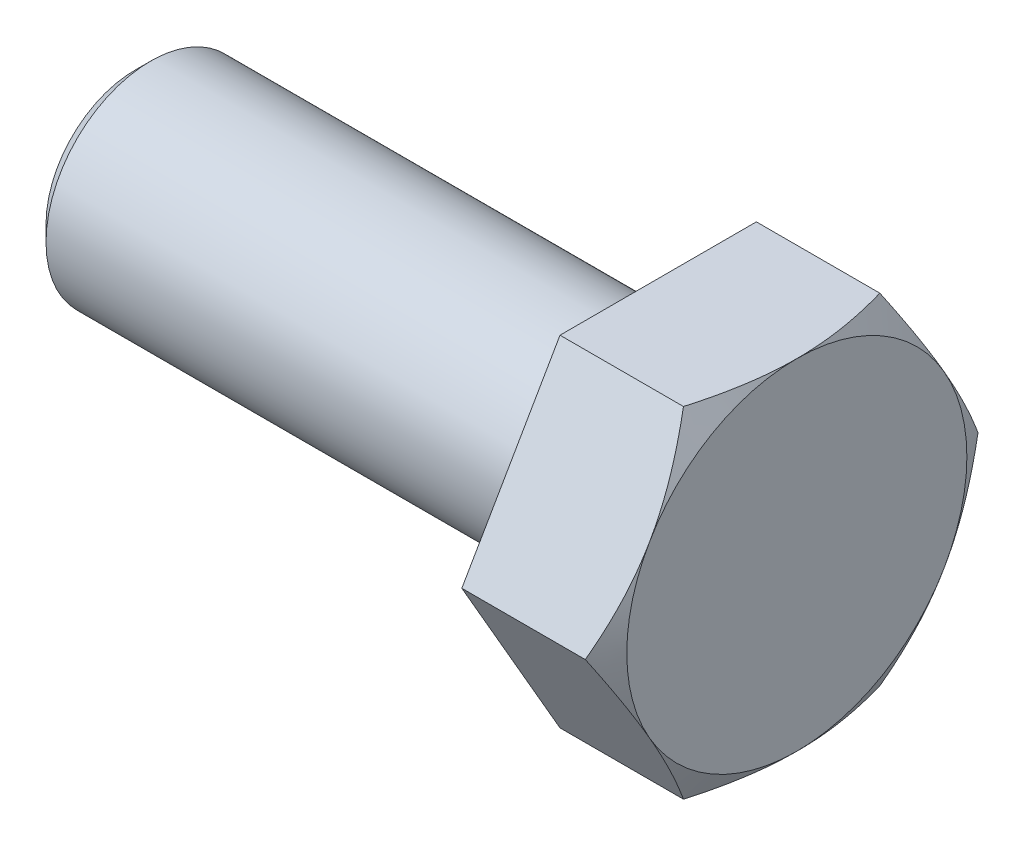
ISO-10303-21;
HEADER;
FILE_DESCRIPTION(('STEP AP214'),'2;1');
FILE_NAME('part.step','',(''),(''),'','','');
FILE_SCHEMA(('AUTOMOTIVE_DESIGN { 1 0 10303 214 1 1 1 1 }'));
ENDSEC;
DATA;
#1=APPLICATION_CONTEXT('core data for automotive mechanical design processes');
#2=APPLICATION_PROTOCOL_DEFINITION('international standard','automotive_design',2000,#1);
#3=PRODUCT_CONTEXT('',#1,'mechanical');
#4=PRODUCT('Part','Part','',(#3));
#5=PRODUCT_RELATED_PRODUCT_CATEGORY('part','',(#4));
#6=PRODUCT_DEFINITION_FORMATION('','',#4);
#7=PRODUCT_DEFINITION_CONTEXT('part definition',#1,'design');
#8=PRODUCT_DEFINITION('design','',#6,#7);
#9=PRODUCT_DEFINITION_SHAPE('','',#8);
#10=(LENGTH_UNIT() NAMED_UNIT(*) SI_UNIT(.MILLI.,.METRE.));
#11=(NAMED_UNIT(*) PLANE_ANGLE_UNIT() SI_UNIT($,.RADIAN.));
#12=(NAMED_UNIT(*) SI_UNIT($,.STERADIAN.) SOLID_ANGLE_UNIT());
#13=UNCERTAINTY_MEASURE_WITH_UNIT(LENGTH_MEASURE(1.E-05),#10,'distance_accuracy_value','');
#14=(GEOMETRIC_REPRESENTATION_CONTEXT(3) GLOBAL_UNCERTAINTY_ASSIGNED_CONTEXT((#13)) GLOBAL_UNIT_ASSIGNED_CONTEXT((#10,
#11,#12)) REPRESENTATION_CONTEXT('',''));
#15=CARTESIAN_POINT('',(0.,0.,0.));
#16=DIRECTION('',(0.,0.,1.));
#17=DIRECTION('',(1.,0.,0.));
#18=AXIS2_PLACEMENT_3D('',#15,#16,#17);
#19=CARTESIAN_POINT('',(0.,-6.50000000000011,-3.75277674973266));
#20=DIRECTION('',(-1.,0.,0.));
#21=DIRECTION('',(0.,0.,1.));
#22=AXIS2_PLACEMENT_3D('',#19,#20,#21);
#23=PLANE('',#22);
#24=DIRECTION('',(0.,0.866025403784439,-0.5));
#25=VECTOR('',#24,1.);
#26=CARTESIAN_POINT('',(0.,-6.50000000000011,-3.75277674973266));
#27=LINE('',#26,#25);
#28=CARTESIAN_POINT('',(0.,-6.50000000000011,-3.75277674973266));
#29=VERTEX_POINT('',#28);
#30=CARTESIAN_POINT('',(0.,-1.11022302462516E-13,-7.50555349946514));
#31=VERTEX_POINT('',#30);
#32=EDGE_CURVE('E219',#29,#31,#27,.T.);
#33=ORIENTED_EDGE('',*,*,#32,.F.);
#34=DIRECTION('',(0.,0.,-1.));
#35=VECTOR('',#34,1.);
#36=CARTESIAN_POINT('',(0.,-6.50000000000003,3.75277674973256));
#37=LINE('',#36,#35);
#38=CARTESIAN_POINT('',(0.,-6.50000000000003,3.75277674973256));
#39=VERTEX_POINT('',#38);
#40=EDGE_CURVE('E238',#39,#29,#37,.T.);
#41=ORIENTED_EDGE('',*,*,#40,.F.);
#42=DIRECTION('',(0.,-0.866025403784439,-0.5));
#43=VECTOR('',#42,1.);
#44=CARTESIAN_POINT('',(-1.11022302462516E-13,0.,7.50555349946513));
#45=LINE('',#44,#43);
#46=CARTESIAN_POINT('',(-1.11022302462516E-13,0.,7.50555349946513));
#47=VERTEX_POINT('',#46);
#48=EDGE_CURVE('E235',#47,#39,#45,.T.);
#49=ORIENTED_EDGE('',*,*,#48,.F.);
#50=DIRECTION('',(0.,-0.866025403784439,0.5));
#51=VECTOR('',#50,1.);
#52=CARTESIAN_POINT('',(0.,6.49999999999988,3.75277674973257));
#53=LINE('',#52,#51);
#54=CARTESIAN_POINT('',(0.,6.49999999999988,3.75277674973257));
#55=VERTEX_POINT('',#54);
#56=EDGE_CURVE('E233',#55,#47,#53,.T.);
#57=ORIENTED_EDGE('',*,*,#56,.F.);
#58=DIRECTION('',(0.,0.,1.));
#59=VECTOR('',#58,1.);
#60=CARTESIAN_POINT('',(0.,6.49999999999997,-3.75277674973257));
#61=LINE('',#60,#59);
#62=CARTESIAN_POINT('',(0.,6.49999999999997,-3.75277674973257));
#63=VERTEX_POINT('',#62);
#64=EDGE_CURVE('E230',#63,#55,#61,.T.);
#65=ORIENTED_EDGE('',*,*,#64,.F.);
#66=DIRECTION('',(0.,0.866025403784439,0.5));
#67=VECTOR('',#66,1.);
#68=CARTESIAN_POINT('',(0.,-1.11022302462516E-13,-7.50555349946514));
#69=LINE('',#68,#67);
#70=EDGE_CURVE('E222',#31,#63,#69,.T.);
#71=ORIENTED_EDGE('',*,*,#70,.F.);
#72=EDGE_LOOP('',(#33,#41,#49,#57,#65,#71));
#73=FACE_BOUND('',#72,.T.);
#74=CARTESIAN_POINT('',(0.,0.,0.));
#75=DIRECTION('',(-1.,0.,0.));
#76=DIRECTION('',(0.,0.,1.));
#77=AXIS2_PLACEMENT_3D('',#74,#75,#76);
#78=CIRCLE('',#77,4.);
#79=CARTESIAN_POINT('',(0.,0.,4.));
#80=VERTEX_POINT('',#79);
#81=EDGE_CURVE('E217',#80,#80,#78,.T.);
#82=ORIENTED_EDGE('',*,*,#81,.F.);
#83=EDGE_LOOP('',(#82));
#84=FACE_BOUND('',#83,.T.);
#85=ADVANCED_FACE('F43',(#73,#84),#23,.T.);
#86=CARTESIAN_POINT('',(5.30000000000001,-6.5000000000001,-3.75277674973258));
#87=DIRECTION('',(0.,0.5,0.866025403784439));
#88=DIRECTION('',(0.,-0.866025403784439,0.5));
#89=AXIS2_PLACEMENT_3D('',#86,#87,#88);
#90=PLANE('',#89);
#91=DIRECTION('',(-1.,0.,0.));
#92=VECTOR('',#91,1.);
#93=CARTESIAN_POINT('',(5.29999999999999,0.,-7.50555349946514));
#94=LINE('',#93,#92);
#95=CARTESIAN_POINT('',(4.71944341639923,0.,-7.50555349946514));
#96=VERTEX_POINT('',#95);
#97=EDGE_CURVE('E137',#96,#31,#94,.T.);
#98=ORIENTED_EDGE('',*,*,#97,.F.);
#99=CARTESIAN_POINT('',(4.71937674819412,0.000199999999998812,-7.50566896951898));
#100=CARTESIAN_POINT('',(4.76699557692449,-0.142677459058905,-7.42317863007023));
#101=CARTESIAN_POINT('',(4.81245329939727,-0.286087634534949,-7.34038072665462));
#102=CARTESIAN_POINT('',(4.89845131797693,-0.574072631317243,-7.1741125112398));
#103=CARTESIAN_POINT('',(4.93898949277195,-0.718647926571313,-7.09064192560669));
#104=CARTESIAN_POINT('',(5.05242899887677,-1.15468865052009,-6.83889369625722));
#105=CARTESIAN_POINT('',(5.11695219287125,-1.44787528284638,-6.66962231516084));
#106=CARTESIAN_POINT('',(5.1926134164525,-1.88662374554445,-6.41631077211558));
#107=CARTESIAN_POINT('',(5.214167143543,-2.03087463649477,-6.33302748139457));
#108=CARTESIAN_POINT('',(5.25030968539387,-2.32002821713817,-6.16608458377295));
#109=CARTESIAN_POINT('',(5.26489911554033,-2.46493084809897,-6.08242501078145));
#110=CARTESIAN_POINT('',(5.28674124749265,-2.75498777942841,-5.91496056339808));
#111=CARTESIAN_POINT('',(5.29400227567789,-2.90014160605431,-5.83115596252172));
#112=CARTESIAN_POINT('',(5.30103969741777,-3.19057533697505,-5.66347396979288));
#113=CARTESIAN_POINT('',(5.3008163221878,-3.33585523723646,-5.57959658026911));
#114=CARTESIAN_POINT('',(5.28991654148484,-3.73387594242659,-5.34979921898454));
#115=CARTESIAN_POINT('',(5.27161818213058,-3.98648646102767,-5.20395446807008));
#116=CARTESIAN_POINT('',(5.21359365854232,-4.49002967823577,-4.91323365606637));
#117=CARTESIAN_POINT('',(5.17384766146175,-4.74096060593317,-4.76835861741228));
#118=CARTESIAN_POINT('',(5.07449409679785,-5.2455172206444,-4.47705272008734));
#119=CARTESIAN_POINT('',(5.01446557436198,-5.49907924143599,-4.33065861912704));
#120=CARTESIAN_POINT('',(4.87822500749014,-6.00242193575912,-4.04005357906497));
#121=CARTESIAN_POINT('',(4.80204496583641,-6.25220905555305,-3.89583891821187));
#122=CARTESIAN_POINT('',(4.71937674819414,-6.5002000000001,-3.75266127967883));
#123=B_SPLINE_CURVE_WITH_KNOTS('',3,(#99,#100,#101,#102,#103,#104,#105,#106,#107,#108,#109,#110,
#111,#112,#113,#114,#115,#116,#117,#118,#119,#120,#121,#122),.UNSPECIFIED.,.F.,.F.,(4,2,2,2,2,2,
2,2,2,2,2,4),(0.,0.515105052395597,1.03043143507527,2.06322554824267,2.56697389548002,
3.0706777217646,3.57380860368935,4.07692394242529,4.95279354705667,5.82947446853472,
6.72559912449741,7.61996451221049),.UNSPECIFIED.);
#124=CARTESIAN_POINT('',(5.30000000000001,-3.2500000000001,-5.62916512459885));
#125=VERTEX_POINT('',#124);
#126=EDGE_CURVE('E151',#96,#125,#123,.T.);
#127=ORIENTED_EDGE('',*,*,#126,.T.);
#128=CARTESIAN_POINT('',(4.71944341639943,-6.5000000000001,-3.75277674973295));
#129=VERTEX_POINT('',#128);
#130=EDGE_CURVE('E159',#125,#129,#123,.T.);
#131=ORIENTED_EDGE('',*,*,#130,.T.);
#132=DIRECTION('',(-1.,0.,0.));
#133=VECTOR('',#132,1.);
#134=CARTESIAN_POINT('',(5.30000000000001,-6.5000000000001,-3.75277674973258));
#135=LINE('',#134,#133);
#136=EDGE_CURVE('E241',#129,#29,#135,.T.);
#137=ORIENTED_EDGE('',*,*,#136,.T.);
#138=ORIENTED_EDGE('',*,*,#32,.T.);
#139=EDGE_LOOP('',(#98,#127,#131,#137,#138));
#140=FACE_BOUND('',#139,.T.);
#141=ADVANCED_FACE('F45',(#140),#90,.F.);
#142=CARTESIAN_POINT('',(5.29999999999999,0.,-7.50555349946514));
#143=DIRECTION('',(0.,-0.5,0.866025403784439));
#144=DIRECTION('',(0.,-0.866025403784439,-0.5));
#145=AXIS2_PLACEMENT_3D('',#142,#143,#144);
#146=PLANE('',#145);
#147=DIRECTION('',(-1.,0.,0.));
#148=VECTOR('',#147,1.);
#149=CARTESIAN_POINT('',(5.3,6.49999999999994,-3.75277674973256));
#150=LINE('',#149,#148);
#151=CARTESIAN_POINT('',(4.71944341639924,6.49999999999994,-3.75277674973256));
#152=VERTEX_POINT('',#151);
#153=EDGE_CURVE('E248',#152,#63,#150,.T.);
#154=ORIENTED_EDGE('',*,*,#153,.F.);
#155=CARTESIAN_POINT('',(4.71937674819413,6.50019999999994,-3.75266127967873));
#156=CARTESIAN_POINT('',(4.76699557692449,6.35732254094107,-3.83515161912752));
#157=CARTESIAN_POINT('',(4.81245329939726,6.21391236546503,-3.91794952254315));
#158=CARTESIAN_POINT('',(4.89845131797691,5.92592736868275,-4.08421773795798));
#159=CARTESIAN_POINT('',(4.93898949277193,5.78135207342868,-4.16768832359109));
#160=CARTESIAN_POINT('',(5.05242899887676,5.34531134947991,-4.41943655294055));
#161=CARTESIAN_POINT('',(5.11695219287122,5.05212471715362,-4.58870793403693));
#162=CARTESIAN_POINT('',(5.19261341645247,4.61337625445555,-4.8420194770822));
#163=CARTESIAN_POINT('',(5.21416714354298,4.46912536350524,-4.92530276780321));
#164=CARTESIAN_POINT('',(5.25030968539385,4.17997178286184,-5.09224566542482));
#165=CARTESIAN_POINT('',(5.2648991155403,4.03506915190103,-5.17590523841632));
#166=CARTESIAN_POINT('',(5.28674124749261,3.7450122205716,-5.34336968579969));
#167=CARTESIAN_POINT('',(5.29400227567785,3.59985839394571,-5.42717428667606));
#168=CARTESIAN_POINT('',(5.30103969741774,3.30942466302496,-5.59485627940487));
#169=CARTESIAN_POINT('',(5.3008163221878,3.16414476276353,-5.67873366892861));
#170=CARTESIAN_POINT('',(5.28991654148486,2.76612405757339,-5.90853103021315));
#171=CARTESIAN_POINT('',(5.27161818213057,2.51351353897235,-6.05437578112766));
#172=CARTESIAN_POINT('',(5.21359365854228,2.00997032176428,-6.3450965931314));
#173=CARTESIAN_POINT('',(5.17384766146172,1.75903939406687,-6.48997163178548));
#174=CARTESIAN_POINT('',(5.07449409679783,1.25448277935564,-6.7812775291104));
#175=CARTESIAN_POINT('',(5.01446557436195,1.00092075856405,-6.92767163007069));
#176=CARTESIAN_POINT('',(4.87822500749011,0.497578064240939,-7.21827667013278));
#177=CARTESIAN_POINT('',(4.80204496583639,0.247790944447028,-7.3624913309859));
#178=CARTESIAN_POINT('',(4.71937674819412,-0.000200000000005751,-7.50566896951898));
#179=B_SPLINE_CURVE_WITH_KNOTS('',3,(#155,#156,#157,#158,#159,#160,#161,#162,#163,#164,#165,
#166,#167,#168,#169,#170,#171,#172,#173,#174,#175,#176,#177,#178),.UNSPECIFIED.,.F.,.F.,(4,2,2,
2,2,2,2,2,2,2,2,4),(0.,0.51510505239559,1.03043143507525,2.06322554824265,2.56697389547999,
3.07067772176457,3.57380860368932,4.07692394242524,4.95279354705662,5.82947446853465,
6.72559912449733,7.6199645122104),.UNSPECIFIED.);
#180=CARTESIAN_POINT('',(5.3,3.24999999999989,-5.62916512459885));
#181=VERTEX_POINT('',#180);
#182=EDGE_CURVE('E126',#152,#181,#179,.T.);
#183=ORIENTED_EDGE('',*,*,#182,.T.);
#184=EDGE_CURVE('E148',#181,#96,#179,.T.);
#185=ORIENTED_EDGE('',*,*,#184,.T.);
#186=ORIENTED_EDGE('',*,*,#97,.T.);
#187=ORIENTED_EDGE('',*,*,#70,.T.);
#188=EDGE_LOOP('',(#154,#183,#185,#186,#187));
#189=FACE_BOUND('',#188,.T.);
#190=ADVANCED_FACE('F263',(#189),#146,.F.);
#191=CARTESIAN_POINT('',(5.3,6.49999999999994,-3.75277674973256));
#192=DIRECTION('',(0.,-1.,0.));
#193=DIRECTION('',(0.,0.,-1.));
#194=AXIS2_PLACEMENT_3D('',#191,#192,#193);
#195=PLANE('',#194);
#196=DIRECTION('',(-1.,0.,0.));
#197=VECTOR('',#196,1.);
#198=CARTESIAN_POINT('',(5.3,6.49999999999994,3.75277674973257));
#199=LINE('',#198,#197);
#200=CARTESIAN_POINT('',(4.71944341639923,6.49999999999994,3.75277674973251));
#201=VERTEX_POINT('',#200);
#202=EDGE_CURVE('E246',#201,#55,#199,.T.);
#203=ORIENTED_EDGE('',*,*,#202,.F.);
#204=CARTESIAN_POINT('',(2.048837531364,6.49999999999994,-10.242826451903));
#205=CARTESIAN_POINT('',(2.18789595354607,6.49999999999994,-9.95749124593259));
#206=CARTESIAN_POINT('',(2.32566707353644,6.49999999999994,-9.6715181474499));
#207=CARTESIAN_POINT('',(2.59791369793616,6.49999999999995,-9.09795747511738));
#208=CARTESIAN_POINT('',(2.73238871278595,6.49999999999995,-8.81036966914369));
#209=CARTESIAN_POINT('',(2.99796413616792,6.49999999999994,-8.2318359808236));
#210=CARTESIAN_POINT('',(3.12904354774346,6.49999999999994,-7.9408804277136));
#211=CARTESIAN_POINT('',(3.3860497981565,6.49999999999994,-7.35671087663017));
#212=CARTESIAN_POINT('',(3.51197687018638,6.49999999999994,-7.0634969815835));
#213=CARTESIAN_POINT('',(3.76148583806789,6.49999999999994,-6.46434921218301));
#214=CARTESIAN_POINT('',(3.88484316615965,6.49999999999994,-6.15832132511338));
#215=CARTESIAN_POINT('',(4.12260875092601,6.49999999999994,-5.54274557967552));
#216=CARTESIAN_POINT('',(4.23701602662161,6.49999999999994,-5.23319733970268));
#217=CARTESIAN_POINT('',(4.45399730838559,6.49999999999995,-4.61061796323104));
#218=CARTESIAN_POINT('',(4.55659391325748,6.49999999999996,-4.29759477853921));
#219=CARTESIAN_POINT('',(4.74676876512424,6.49999999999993,-3.6670577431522));
#220=CARTESIAN_POINT('',(4.83435157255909,6.49999999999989,-3.34954528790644));
#221=CARTESIAN_POINT('',(4.98994277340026,6.49999999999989,-2.71162315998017));
#222=CARTESIAN_POINT('',(5.05806094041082,6.49999999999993,-2.39124068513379));
#223=CARTESIAN_POINT('',(5.17096432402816,6.49999999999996,-1.74628166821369));
#224=CARTESIAN_POINT('',(5.21575208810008,6.49999999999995,-1.42170558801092));
#225=CARTESIAN_POINT('',(5.26247031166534,6.49999999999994,-0.935153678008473));
#226=CARTESIAN_POINT('',(5.27461755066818,6.49999999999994,-0.774120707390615));
#227=CARTESIAN_POINT('',(5.29209027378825,6.49999999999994,-0.451677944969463));
#228=CARTESIAN_POINT('',(5.29741587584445,6.49999999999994,-0.290268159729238));
#229=CARTESIAN_POINT('',(5.30111032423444,6.49999999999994,0.0326315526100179));
#230=CARTESIAN_POINT('',(5.29947913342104,6.49999999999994,0.19412148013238));
#231=CARTESIAN_POINT('',(5.28930353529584,6.49999999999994,0.516885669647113));
#232=CARTESIAN_POINT('',(5.28075881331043,6.49999999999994,0.678159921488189));
#233=CARTESIAN_POINT('',(5.25246253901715,6.49999999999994,1.06087214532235));
#234=CARTESIAN_POINT('',(5.22970222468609,6.49999999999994,1.28209275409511));
#235=CARTESIAN_POINT('',(5.17237790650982,6.49999999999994,1.72298724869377));
#236=CARTESIAN_POINT('',(5.13781243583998,6.49999999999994,1.94266093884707));
#237=CARTESIAN_POINT('',(5.01823337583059,6.49999999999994,2.59905069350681));
#238=CARTESIAN_POINT('',(4.91735524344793,6.49999999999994,3.03292019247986));
#239=CARTESIAN_POINT('',(4.7411776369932,6.49999999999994,3.68203060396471));
#240=CARTESIAN_POINT('',(4.67743243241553,6.49999999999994,3.90060193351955));
#241=CARTESIAN_POINT('',(4.54301316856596,6.49999999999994,4.33562457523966));
#242=CARTESIAN_POINT('',(4.47233905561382,6.49999999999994,4.55207587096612));
#243=CARTESIAN_POINT('',(4.32522134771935,6.49999999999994,4.98292315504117));
#244=CARTESIAN_POINT('',(4.2487793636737,6.49999999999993,5.19731969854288));
#245=CARTESIAN_POINT('',(4.09105605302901,6.49999999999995,5.62431368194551));
#246=CARTESIAN_POINT('',(4.00977483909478,6.49999999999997,5.83691116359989));
#247=CARTESIAN_POINT('',(3.78396124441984,6.49999999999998,6.41107024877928));
#248=CARTESIAN_POINT('',(3.63553739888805,6.49999999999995,6.77109994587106));
#249=CARTESIAN_POINT('',(3.32991367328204,6.49999999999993,7.48742894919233));
#250=CARTESIAN_POINT('',(3.17271280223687,6.49999999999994,7.84372782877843));
#251=CARTESIAN_POINT('',(2.85162072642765,6.49999999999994,8.55345570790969));
#252=CARTESIAN_POINT('',(2.68772693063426,6.49999999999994,8.90688353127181));
#253=CARTESIAN_POINT('',(2.35485675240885,6.49999999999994,9.61131133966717));
#254=CARTESIAN_POINT('',(2.18588058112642,6.49999999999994,9.96231142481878));
#255=CARTESIAN_POINT('',(1.84367823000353,6.49999999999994,10.6629371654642));
#256=CARTESIAN_POINT('',(1.67044558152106,6.49999999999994,11.0125596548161));
#257=CARTESIAN_POINT('',(1.32082260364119,6.49999999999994,11.7102232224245));
#258=CARTESIAN_POINT('',(1.14443224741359,6.49999999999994,12.0582642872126));
#259=CARTESIAN_POINT('',(0.789156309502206,6.49999999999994,12.7529700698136));
#260=CARTESIAN_POINT('',(0.610271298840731,6.49999999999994,13.0996350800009));
#261=CARTESIAN_POINT('',(0.250435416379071,6.49999999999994,13.7918918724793));
#262=CARTESIAN_POINT('',(0.0694845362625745,6.49999999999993,14.1374836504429));
#263=CARTESIAN_POINT('',(-0.437179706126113,6.49999999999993,15.0993998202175));
#264=CARTESIAN_POINT('',(-0.76474827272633,6.49999999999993,15.7147468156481));
#265=CARTESIAN_POINT('',(-1.42381233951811,6.49999999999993,16.9433793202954));
#266=CARTESIAN_POINT('',(-1.75530808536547,6.49999999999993,17.5566646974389));
#267=CARTESIAN_POINT('',(-2.42008717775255,6.49999999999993,18.7795711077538));
#268=CARTESIAN_POINT('',(-2.75336064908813,6.49999999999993,19.3891975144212));
#269=CARTESIAN_POINT('',(-3.42213981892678,6.49999999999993,20.6071616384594));
#270=CARTESIAN_POINT('',(-3.75764533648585,6.49999999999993,21.215499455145));
#271=CARTESIAN_POINT('',(-4.09396124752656,6.49999999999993,21.8233856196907));
#272=B_SPLINE_CURVE_WITH_KNOTS('',3,(#204,#205,#206,#207,#208,#209,#210,#211,#212,#213,#214,
#215,#216,#217,#218,#219,#220,#221,#222,#223,#224,#225,#226,#227,#228,#229,#230,#231,#232,#233,
#234,#235,#236,#237,#238,#239,#240,#241,#242,#243,#244,#245,#246,#247,#248,#249,#250,#251,#252,
#253,#254,#255,#256,#257,#258,#259,#260,#261,#262,#263,#264,#265,#266,#267,#268,#269,#270,#271),
.UNSPECIFIED.,.F.,.F.,(4,2,2,2,2,2,2,2,2,2,2,2,2,2,2,2,2,2,2,2,2,2,2,2,2,2,2,2,2,2,2,2,2,4),(0.,
0.952261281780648,1.90466315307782,2.86198011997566,3.81925371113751,4.80900961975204,
5.79887385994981,6.78681143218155,7.77444838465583,8.75640023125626,9.73824483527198,
10.222593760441,10.7069343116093,11.1912774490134,11.6756426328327,12.3424346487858,
13.0093095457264,14.3437044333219,15.0266742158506,15.7096492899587,16.3924343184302,
17.0752034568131,18.2433007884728,19.4115302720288,20.580216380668,21.7488540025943,
22.9193933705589,24.0899426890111,25.2602283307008,26.430518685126,28.5218066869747,
30.6132262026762,32.6975528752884,34.7817125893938),.UNSPECIFIED.);
#273=CARTESIAN_POINT('',(5.3,6.49999999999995,0.));
#274=VERTEX_POINT('',#273);
#275=EDGE_CURVE('E121',#201,#274,#272,.F.);
#276=ORIENTED_EDGE('',*,*,#275,.T.);
#277=EDGE_CURVE('E125',#274,#152,#272,.F.);
#278=ORIENTED_EDGE('',*,*,#277,.T.);
#279=ORIENTED_EDGE('',*,*,#153,.T.);
#280=ORIENTED_EDGE('',*,*,#64,.T.);
#281=EDGE_LOOP('',(#203,#276,#278,#279,#280));
#282=FACE_BOUND('',#281,.T.);
#283=ADVANCED_FACE('F268',(#282),#195,.F.);
#284=CARTESIAN_POINT('',(5.3,6.49999999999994,3.75277674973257));
#285=DIRECTION('',(0.,-0.5,-0.866025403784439));
#286=DIRECTION('',(0.,0.866025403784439,-0.5));
#287=AXIS2_PLACEMENT_3D('',#284,#285,#286);
#288=PLANE('',#287);
#289=DIRECTION('',(-1.,0.,0.));
#290=VECTOR('',#289,1.);
#291=CARTESIAN_POINT('',(5.3,0.,7.50555349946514));
#292=LINE('',#291,#290);
#293=CARTESIAN_POINT('',(4.71944341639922,0.,7.50555349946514));
#294=VERTEX_POINT('',#293);
#295=EDGE_CURVE('E147',#294,#47,#292,.T.);
#296=ORIENTED_EDGE('',*,*,#295,.F.);
#297=CARTESIAN_POINT('',(4.71937674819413,-0.000200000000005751,7.50566896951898));
#298=CARTESIAN_POINT('',(4.76699557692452,0.142677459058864,7.42317863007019));
#299=CARTESIAN_POINT('',(4.8124532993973,0.286087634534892,7.34038072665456));
#300=CARTESIAN_POINT('',(4.89845131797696,0.574072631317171,7.17411251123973));
#301=CARTESIAN_POINT('',(4.93898949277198,0.718647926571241,7.09064192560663));
#302=CARTESIAN_POINT('',(5.0524289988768,1.15468865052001,6.83889369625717));
#303=CARTESIAN_POINT('',(5.11695219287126,1.4478752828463,6.66962231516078));
#304=CARTESIAN_POINT('',(5.19261341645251,1.88662374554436,6.41631077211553));
#305=CARTESIAN_POINT('',(5.21416714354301,2.03087463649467,6.33302748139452));
#306=CARTESIAN_POINT('',(5.25030968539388,2.32002821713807,6.16608458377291));
#307=CARTESIAN_POINT('',(5.26489911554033,2.46493084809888,6.0824250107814));
#308=CARTESIAN_POINT('',(5.28674124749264,2.75498777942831,5.91496056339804));
#309=CARTESIAN_POINT('',(5.29400227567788,2.90014160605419,5.83115596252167));
#310=CARTESIAN_POINT('',(5.30103969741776,3.19057533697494,5.66347396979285));
#311=CARTESIAN_POINT('',(5.30081632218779,3.33585523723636,5.5795965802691));
#312=CARTESIAN_POINT('',(5.28991654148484,3.7338759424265,5.34979921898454));
#313=CARTESIAN_POINT('',(5.27161818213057,3.98648646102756,5.20395446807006));
#314=CARTESIAN_POINT('',(5.21359365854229,4.49002967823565,4.91323365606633));
#315=CARTESIAN_POINT('',(5.17384766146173,4.74096060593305,4.76835861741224));
#316=CARTESIAN_POINT('',(5.07449409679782,5.24551722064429,4.47705272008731));
#317=CARTESIAN_POINT('',(5.01446557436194,5.49907924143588,4.33065861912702));
#318=CARTESIAN_POINT('',(4.8782250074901,6.002421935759,4.04005357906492));
#319=CARTESIAN_POINT('',(4.80204496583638,6.25220905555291,3.89583891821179));
#320=CARTESIAN_POINT('',(4.71937674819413,6.50019999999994,3.75266127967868));
#321=B_SPLINE_CURVE_WITH_KNOTS('',3,(#297,#298,#299,#300,#301,#302,#303,#304,#305,#306,#307,
#308,#309,#310,#311,#312,#313,#314,#315,#316,#317,#318,#319,#320),.UNSPECIFIED.,.F.,.F.,(4,2,2,
2,2,2,2,2,2,2,2,4),(0.,0.515105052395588,1.03043143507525,2.06322554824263,2.56697389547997,
3.07067772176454,3.57380860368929,4.07692394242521,4.9527935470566,5.82947446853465,
6.72559912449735,7.61996451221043),.UNSPECIFIED.);
#322=CARTESIAN_POINT('',(5.3,3.25,5.62916512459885));
#323=VERTEX_POINT('',#322);
#324=EDGE_CURVE('E128',#294,#323,#321,.T.);
#325=ORIENTED_EDGE('',*,*,#324,.T.);
#326=EDGE_CURVE('E114',#323,#201,#321,.T.);
#327=ORIENTED_EDGE('',*,*,#326,.T.);
#328=ORIENTED_EDGE('',*,*,#202,.T.);
#329=ORIENTED_EDGE('',*,*,#56,.T.);
#330=EDGE_LOOP('',(#296,#325,#327,#328,#329));
#331=FACE_BOUND('',#330,.T.);
#332=ADVANCED_FACE('F145',(#331),#288,.F.);
#333=CARTESIAN_POINT('',(5.3,0.,7.50555349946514));
#334=DIRECTION('',(0.,0.5,-0.866025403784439));
#335=DIRECTION('',(0.,0.866025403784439,0.5));
#336=AXIS2_PLACEMENT_3D('',#333,#334,#335);
#337=PLANE('',#336);
#338=DIRECTION('',(-1.,0.,0.));
#339=VECTOR('',#338,1.);
#340=CARTESIAN_POINT('',(5.3,-6.50000000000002,3.75277674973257));
#341=LINE('',#340,#339);
#342=CARTESIAN_POINT('',(4.71944341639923,-6.50000000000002,3.75277674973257));
#343=VERTEX_POINT('',#342);
#344=EDGE_CURVE('E243',#343,#39,#341,.T.);
#345=ORIENTED_EDGE('',*,*,#344,.F.);
#346=CARTESIAN_POINT('',(4.71937674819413,-6.50020000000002,3.75266127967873));
#347=CARTESIAN_POINT('',(4.76699557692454,-6.35732254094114,3.8351516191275));
#348=CARTESIAN_POINT('',(4.81245329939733,-6.21391236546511,3.91794952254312));
#349=CARTESIAN_POINT('',(4.898451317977,-5.92592736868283,4.08421773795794));
#350=CARTESIAN_POINT('',(4.93898949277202,-5.78135207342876,4.16768832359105));
#351=CARTESIAN_POINT('',(5.05242899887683,-5.34531134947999,4.41943655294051));
#352=CARTESIAN_POINT('',(5.1169521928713,-5.0521247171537,4.58870793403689));
#353=CARTESIAN_POINT('',(5.19261341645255,-4.61337625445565,4.84201947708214));
#354=CARTESIAN_POINT('',(5.21416714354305,-4.46912536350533,4.92530276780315));
#355=CARTESIAN_POINT('',(5.25030968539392,-4.17997178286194,5.09224566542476));
#356=CARTESIAN_POINT('',(5.26489911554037,-4.03506915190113,5.17590523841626));
#357=CARTESIAN_POINT('',(5.28674124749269,-3.7450122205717,5.34336968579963));
#358=CARTESIAN_POINT('',(5.29400227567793,-3.59985839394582,5.427174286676));
#359=CARTESIAN_POINT('',(5.30103969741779,-3.30942466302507,5.59485627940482));
#360=CARTESIAN_POINT('',(5.3008163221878,-3.16414476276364,5.67873366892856));
#361=CARTESIAN_POINT('',(5.28991654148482,-2.76612405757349,5.90853103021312));
#362=CARTESIAN_POINT('',(5.2716181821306,-2.51351353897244,6.05437578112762));
#363=CARTESIAN_POINT('',(5.21359365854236,-2.00997032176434,6.34509659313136));
#364=CARTESIAN_POINT('',(5.17384766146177,-1.75903939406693,6.48997163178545));
#365=CARTESIAN_POINT('',(5.07449409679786,-1.25448277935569,6.78127752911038));
#366=CARTESIAN_POINT('',(5.01446557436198,-1.0009207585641,6.92767163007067));
#367=CARTESIAN_POINT('',(4.87822500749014,-0.497578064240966,7.21827667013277));
#368=CARTESIAN_POINT('',(4.80204496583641,-0.247790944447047,7.36249133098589));
#369=CARTESIAN_POINT('',(4.71937674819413,0.000199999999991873,7.50566896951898));
#370=B_SPLINE_CURVE_WITH_KNOTS('',3,(#346,#347,#348,#349,#350,#351,#352,#353,#354,#355,#356,
#357,#358,#359,#360,#361,#362,#363,#364,#365,#366,#367,#368,#369),.UNSPECIFIED.,.F.,.F.,(4,2,2,
2,2,2,2,2,2,2,2,4),(0.,0.51510505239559,1.03043143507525,2.06322554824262,2.56697389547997,
3.07067772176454,3.57380860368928,4.07692394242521,4.95279354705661,5.82947446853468,
6.72559912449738,7.61996451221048),.UNSPECIFIED.);
#371=CARTESIAN_POINT('',(5.3,-3.25,5.6291651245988));
#372=VERTEX_POINT('',#371);
#373=EDGE_CURVE('E63',#343,#372,#370,.T.);
#374=ORIENTED_EDGE('',*,*,#373,.T.);
#375=EDGE_CURVE('E134',#372,#294,#370,.T.);
#376=ORIENTED_EDGE('',*,*,#375,.T.);
#377=ORIENTED_EDGE('',*,*,#295,.T.);
#378=ORIENTED_EDGE('',*,*,#48,.T.);
#379=EDGE_LOOP('',(#345,#374,#376,#377,#378));
#380=FACE_BOUND('',#379,.T.);
#381=ADVANCED_FACE('F193',(#380),#337,.F.);
#382=CARTESIAN_POINT('',(5.3,-6.50000000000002,3.75277674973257));
#383=DIRECTION('',(0.,1.,0.));
#384=DIRECTION('',(0.,0.,1.));
#385=AXIS2_PLACEMENT_3D('',#382,#383,#384);
#386=PLANE('',#385);
#387=ORIENTED_EDGE('',*,*,#136,.F.);
#388=CARTESIAN_POINT('',(2.04883753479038,-6.50000000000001,-10.2428264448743));
#389=CARTESIAN_POINT('',(2.18789595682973,-6.50000000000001,-9.95749123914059));
#390=CARTESIAN_POINT('',(2.32566707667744,-6.50000000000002,-9.67151814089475));
#391=CARTESIAN_POINT('',(2.59791370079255,-6.50000000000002,-9.09795746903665));
#392=CARTESIAN_POINT('',(2.73238871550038,-6.50000000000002,-8.81036966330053));
#393=CARTESIAN_POINT('',(2.99796413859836,-6.50000000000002,-8.23183597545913));
#394=CARTESIAN_POINT('',(3.1290435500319,-6.50000000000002,-7.94088042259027));
#395=CARTESIAN_POINT('',(3.38604980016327,-6.50000000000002,-7.35671087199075));
#396=CARTESIAN_POINT('',(3.51197687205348,-6.50000000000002,-7.06349697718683));
#397=CARTESIAN_POINT('',(3.76148583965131,-6.50000000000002,-6.46434920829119));
#398=CARTESIAN_POINT('',(3.8848431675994,-6.50000000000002,-6.15832132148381));
#399=CARTESIAN_POINT('',(4.122608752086,-6.50000000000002,-5.54274557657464));
#400=CARTESIAN_POINT('',(4.23701602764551,-6.50000000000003,-5.23319733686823));
#401=CARTESIAN_POINT('',(4.45399730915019,-6.50000000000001,-4.61061796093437));
#402=CARTESIAN_POINT('',(4.55659391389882,-6.5,-4.29759477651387));
#403=CARTESIAN_POINT('',(4.7467687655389,-6.50000000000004,-3.66705774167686));
#404=CARTESIAN_POINT('',(4.83435157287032,-6.50000000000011,-3.34954528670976));
#405=CARTESIAN_POINT('',(4.98994277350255,-6.50000000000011,-2.71162315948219));
#406=CARTESIAN_POINT('',(5.0580609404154,-6.50000000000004,-2.39124068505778));
#407=CARTESIAN_POINT('',(5.17096432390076,-6.5,-1.74628166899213));
#408=CARTESIAN_POINT('',(5.21575208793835,-6.50000000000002,-1.42170558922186));
#409=CARTESIAN_POINT('',(5.26247031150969,-6.50000000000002,-0.935153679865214));
#410=CARTESIAN_POINT('',(5.27461755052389,-6.50000000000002,-0.774120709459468));
#411=CARTESIAN_POINT('',(5.29209027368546,-6.50000000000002,-0.451677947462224));
#412=CARTESIAN_POINT('',(5.29741587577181,-6.50000000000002,-0.290268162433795));
#413=CARTESIAN_POINT('',(5.30111032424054,-6.50000000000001,0.0326315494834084));
#414=CARTESIAN_POINT('',(5.29947913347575,-6.5,0.194121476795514));
#415=CARTESIAN_POINT('',(5.28930353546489,-6.50000000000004,0.51688566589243));
#416=CARTESIAN_POINT('',(5.28075881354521,-6.5000000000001,0.678159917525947));
#417=CARTESIAN_POINT('',(5.2524625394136,-6.50000000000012,1.06087214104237));
#418=CARTESIAN_POINT('',(5.22970222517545,-6.50000000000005,1.28209274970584));
#419=CARTESIAN_POINT('',(5.17237790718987,-6.49999999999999,1.72298724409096));
#420=CARTESIAN_POINT('',(5.13781243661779,-6.50000000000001,1.94266093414));
#421=CARTESIAN_POINT('',(5.01823337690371,-6.50000000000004,2.59905068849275));
#422=CARTESIAN_POINT('',(4.91735524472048,-6.50000000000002,3.03292018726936));
#423=CARTESIAN_POINT('',(4.74117763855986,-6.50000000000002,3.68203059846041));
#424=CARTESIAN_POINT('',(4.67743243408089,-6.50000000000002,3.90060192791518));
#425=CARTESIAN_POINT('',(4.54301317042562,-6.50000000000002,4.33562456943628));
#426=CARTESIAN_POINT('',(4.4723390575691,-6.50000000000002,4.55207586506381));
#427=CARTESIAN_POINT('',(4.32522134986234,-6.50000000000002,4.98292314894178));
#428=CARTESIAN_POINT('',(4.24877936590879,-6.50000000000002,5.19731969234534));
#429=CARTESIAN_POINT('',(4.09105605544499,-6.50000000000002,5.62431367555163));
#430=CARTESIAN_POINT('',(4.00977484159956,-6.50000000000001,5.83691115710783));
#431=CARTESIAN_POINT('',(3.78396124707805,-6.5,6.4110702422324));
#432=CARTESIAN_POINT('',(3.6355374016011,-6.50000000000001,6.77109993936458));
#433=CARTESIAN_POINT('',(3.32991367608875,-6.50000000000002,7.48742894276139));
#434=CARTESIAN_POINT('',(3.17271280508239,-6.50000000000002,7.84372782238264));
#435=CARTESIAN_POINT('',(2.85162072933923,-6.50000000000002,8.55345570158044));
#436=CARTESIAN_POINT('',(2.68772693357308,-6.50000000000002,8.90688352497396));
#437=CARTESIAN_POINT('',(2.35485675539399,-6.50000000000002,9.61131133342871));
#438=CARTESIAN_POINT('',(2.18588058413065,-6.50000000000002,9.96231141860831));
#439=CARTESIAN_POINT('',(1.84367823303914,-6.50000000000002,10.662937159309));
#440=CARTESIAN_POINT('',(1.67044558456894,-6.50000000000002,11.012559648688));
#441=CARTESIAN_POINT('',(1.32082260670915,-6.50000000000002,11.7102232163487));
#442=CARTESIAN_POINT('',(1.14443225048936,-6.50000000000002,12.058264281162));
#443=CARTESIAN_POINT('',(0.789156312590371,-6.50000000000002,12.7529700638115));
#444=CARTESIAN_POINT('',(0.610271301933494,-6.50000000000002,13.099635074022));
#445=CARTESIAN_POINT('',(0.250435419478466,-6.50000000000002,13.7918918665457));
#446=CARTESIAN_POINT('',(0.0694845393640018,-6.50000000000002,14.1374836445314));
#447=CARTESIAN_POINT('',(-0.437179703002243,-6.50000000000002,15.099399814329));
#448=CARTESIAN_POINT('',(-0.764748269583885,-6.50000000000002,15.7147468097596));
#449=CARTESIAN_POINT('',(-1.42381233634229,-6.50000000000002,16.9433793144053));
#450=CARTESIAN_POINT('',(-1.75530808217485,-6.50000000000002,17.5566646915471));
#451=CARTESIAN_POINT('',(-2.42008717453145,-6.50000000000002,18.7795711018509));
#452=CARTESIAN_POINT('',(-2.75336064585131,-6.50000000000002,19.389197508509));
#453=CARTESIAN_POINT('',(-3.4221398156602,-6.50000000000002,20.6071616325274));
#454=CARTESIAN_POINT('',(-3.75764533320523,-6.50000000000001,21.2154994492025));
#455=CARTESIAN_POINT('',(-4.09396124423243,-6.50000000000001,21.8233856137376));
#456=B_SPLINE_CURVE_WITH_KNOTS('',3,(#388,#389,#390,#391,#392,#393,#394,#395,#396,#397,#398,
#399,#400,#401,#402,#403,#404,#405,#406,#407,#408,#409,#410,#411,#412,#413,#414,#415,#416,#417,
#418,#419,#420,#421,#422,#423,#424,#425,#426,#427,#428,#429,#430,#431,#432,#433,#434,#435,#436,
#437,#438,#439,#440,#441,#442,#443,#444,#445,#446,#447,#448,#449,#450,#451,#452,#453,#454,#455),
.UNSPECIFIED.,.F.,.F.,(4,2,2,2,2,2,2,2,2,2,2,2,2,2,2,2,2,2,2,2,2,2,2,2,2,2,2,2,2,2,2,2,2,4),(0.,
0.952261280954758,1.90466315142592,2.8619801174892,3.81925370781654,4.80900961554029,
5.79887385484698,6.78681142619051,7.77444837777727,8.75640022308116,9.73824482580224,
10.2225937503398,10.7069343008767,11.1912774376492,11.6756426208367,12.3424346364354,
13.0093095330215,14.3437044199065,15.0266742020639,15.7096492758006,16.3924343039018,
17.0752034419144,18.2433007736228,19.411530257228,20.5802163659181,21.7488539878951,
22.9193933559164,24.0899426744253,25.2602283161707,26.4305186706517,28.5218066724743,
30.6132261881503,32.6975528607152,34.7817125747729),.UNSPECIFIED.);
#457=CARTESIAN_POINT('',(5.3,-6.50000000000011,0.));
#458=VERTEX_POINT('',#457);
#459=EDGE_CURVE('E192',#129,#458,#456,.T.);
#460=ORIENTED_EDGE('',*,*,#459,.T.);
#461=EDGE_CURVE('E142',#458,#343,#456,.T.);
#462=ORIENTED_EDGE('',*,*,#461,.T.);
#463=ORIENTED_EDGE('',*,*,#344,.T.);
#464=ORIENTED_EDGE('',*,*,#40,.T.);
#465=EDGE_LOOP('',(#387,#460,#462,#463,#464));
#466=FACE_BOUND('',#465,.T.);
#467=ADVANCED_FACE('F196',(#466),#386,.F.);
#468=CARTESIAN_POINT('',(-19.9999999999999,0.,0.));
#469=DIRECTION('',(1.,0.,0.));
#470=DIRECTION('',(0.,0.,-1.));
#471=AXIS2_PLACEMENT_3D('',#468,#469,#470);
#472=CYLINDRICAL_SURFACE('',#471,4.);
#473=CARTESIAN_POINT('',(-19.3999999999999,0.,0.));
#474=DIRECTION('',(-1.,0.,0.));
#475=DIRECTION('',(0.,0.,1.));
#476=AXIS2_PLACEMENT_3D('',#473,#474,#475);
#477=CIRCLE('',#476,4.);
#478=CARTESIAN_POINT('',(-19.3999999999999,0.,3.99999999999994));
#479=VERTEX_POINT('',#478);
#480=EDGE_CURVE('E13',#479,#479,#477,.F.);
#481=ORIENTED_EDGE('',*,*,#480,.T.);
#482=EDGE_LOOP('',(#481));
#483=FACE_BOUND('',#482,.T.);
#484=ORIENTED_EDGE('',*,*,#81,.T.);
#485=EDGE_LOOP('',(#484));
#486=FACE_BOUND('',#485,.T.);
#487=ADVANCED_FACE('F201',(#483,#486),#472,.T.);
#488=CARTESIAN_POINT('',(-19.9999999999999,0.,0.));
#489=DIRECTION('',(-1.,0.,0.));
#490=DIRECTION('',(0.,0.,1.));
#491=AXIS2_PLACEMENT_3D('',#488,#489,#490);
#492=PLANE('',#491);
#493=CARTESIAN_POINT('',(-19.9999999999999,0.,0.));
#494=DIRECTION('',(-1.,0.,0.));
#495=DIRECTION('',(0.,0.,1.));
#496=AXIS2_PLACEMENT_3D('',#493,#494,#495);
#497=CIRCLE('',#496,3.39999999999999);
#498=CARTESIAN_POINT('',(-19.9999999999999,0.,3.39999999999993));
#499=VERTEX_POINT('',#498);
#500=EDGE_CURVE('E52',#499,#499,#497,.T.);
#501=ORIENTED_EDGE('',*,*,#500,.T.);
#502=EDGE_LOOP('',(#501));
#503=FACE_BOUND('',#502,.T.);
#504=ADVANCED_FACE('F177',(#503),#492,.T.);
#505=CARTESIAN_POINT('',(5.3,-1.11022302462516E-13,0.));
#506=DIRECTION('',(-1.,0.,0.));
#507=DIRECTION('',(0.,0.,1.));
#508=AXIS2_PLACEMENT_3D('',#505,#506,#507);
#509=CONICAL_SURFACE('',#508,6.5,1.0471975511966);
#510=ORIENTED_EDGE('',*,*,#375,.F.);
#511=CARTESIAN_POINT('',(5.3,-1.11022302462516E-13,0.));
#512=DIRECTION('',(-1.,0.,0.));
#513=DIRECTION('',(0.,0.,1.));
#514=AXIS2_PLACEMENT_3D('',#511,#512,#513);
#515=CIRCLE('',#514,6.5);
#516=EDGE_CURVE('E131',#323,#372,#515,.F.);
#517=ORIENTED_EDGE('',*,*,#516,.F.);
#518=ORIENTED_EDGE('',*,*,#324,.F.);
#519=EDGE_LOOP('',(#510,#517,#518));
#520=FACE_BOUND('',#519,.T.);
#521=ADVANCED_FACE('F132',(#520),#509,.T.);
#522=ORIENTED_EDGE('',*,*,#326,.F.);
#523=CARTESIAN_POINT('',(5.3,-1.11022302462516E-13,0.));
#524=DIRECTION('',(-1.,0.,0.));
#525=DIRECTION('',(0.,0.,1.));
#526=AXIS2_PLACEMENT_3D('',#523,#524,#525);
#527=CIRCLE('',#526,6.5);
#528=EDGE_CURVE('E118',#323,#274,#527,.T.);
#529=ORIENTED_EDGE('',*,*,#528,.T.);
#530=ORIENTED_EDGE('',*,*,#275,.F.);
#531=EDGE_LOOP('',(#522,#529,#530));
#532=FACE_BOUND('',#531,.T.);
#533=ADVANCED_FACE('F116',(#532),#509,.T.);
#534=EDGE_CURVE('E136',#181,#274,#515,.F.);
#535=ORIENTED_EDGE('',*,*,#534,.F.);
#536=ORIENTED_EDGE('',*,*,#182,.F.);
#537=ORIENTED_EDGE('',*,*,#277,.F.);
#538=EDGE_LOOP('',(#535,#536,#537));
#539=FACE_BOUND('',#538,.T.);
#540=ADVANCED_FACE('F174',(#539),#509,.T.);
#541=EDGE_CURVE('E255',#125,#181,#515,.F.);
#542=ORIENTED_EDGE('',*,*,#541,.F.);
#543=ORIENTED_EDGE('',*,*,#126,.F.);
#544=ORIENTED_EDGE('',*,*,#184,.F.);
#545=EDGE_LOOP('',(#542,#543,#544));
#546=FACE_BOUND('',#545,.T.);
#547=ADVANCED_FACE('F280',(#546),#509,.T.);
#548=EDGE_CURVE('E252',#458,#125,#515,.F.);
#549=ORIENTED_EDGE('',*,*,#548,.F.);
#550=ORIENTED_EDGE('',*,*,#459,.F.);
#551=ORIENTED_EDGE('',*,*,#130,.F.);
#552=EDGE_LOOP('',(#549,#550,#551));
#553=FACE_BOUND('',#552,.T.);
#554=ADVANCED_FACE('F277',(#553),#509,.T.);
#555=ORIENTED_EDGE('',*,*,#461,.F.);
#556=EDGE_CURVE('E59',#372,#458,#515,.F.);
#557=ORIENTED_EDGE('',*,*,#556,.F.);
#558=ORIENTED_EDGE('',*,*,#373,.F.);
#559=EDGE_LOOP('',(#555,#557,#558));
#560=FACE_BOUND('',#559,.T.);
#561=ADVANCED_FACE('F175',(#560),#509,.T.);
#562=CARTESIAN_POINT('',(5.30000000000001,-6.5000000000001,-3.75277674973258));
#563=DIRECTION('',(-1.,0.,0.));
#564=DIRECTION('',(0.,0.,1.));
#565=AXIS2_PLACEMENT_3D('',#562,#563,#564);
#566=PLANE('',#565);
#567=ORIENTED_EDGE('',*,*,#516,.T.);
#568=ORIENTED_EDGE('',*,*,#556,.T.);
#569=ORIENTED_EDGE('',*,*,#548,.T.);
#570=ORIENTED_EDGE('',*,*,#541,.T.);
#571=ORIENTED_EDGE('',*,*,#534,.T.);
#572=ORIENTED_EDGE('',*,*,#528,.F.);
#573=EDGE_LOOP('',(#567,#568,#569,#570,#571,#572));
#574=FACE_BOUND('',#573,.T.);
#575=ADVANCED_FACE('F139',(#574),#566,.F.);
#576=CARTESIAN_POINT('',(-19.9999999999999,0.,0.));
#577=DIRECTION('',(1.,0.,0.));
#578=DIRECTION('',(0.,0.,-1.));
#579=AXIS2_PLACEMENT_3D('',#576,#577,#578);
#580=CONICAL_SURFACE('',#579,3.39999999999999,0.785398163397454);
#581=ORIENTED_EDGE('',*,*,#480,.F.);
#582=EDGE_LOOP('',(#581));
#583=FACE_BOUND('',#582,.T.);
#584=ORIENTED_EDGE('',*,*,#500,.F.);
#585=EDGE_LOOP('',(#584));
#586=FACE_BOUND('',#585,.T.);
#587=ADVANCED_FACE('F176',(#583,#586),#580,.T.);
#588=CLOSED_SHELL('',(#85,#141,#190,#283,#332,#381,#467,#487,#504,#521,#533,#540,#547,#554,#561,
#575,#587));
#589=MANIFOLD_SOLID_BREP('B2',#588);
#590=ADVANCED_BREP_SHAPE_REPRESENTATION('',(#18,#589),#14);
#591=SHAPE_DEFINITION_REPRESENTATION(#9,#590);
ENDSEC;
END-ISO-10303-21;
